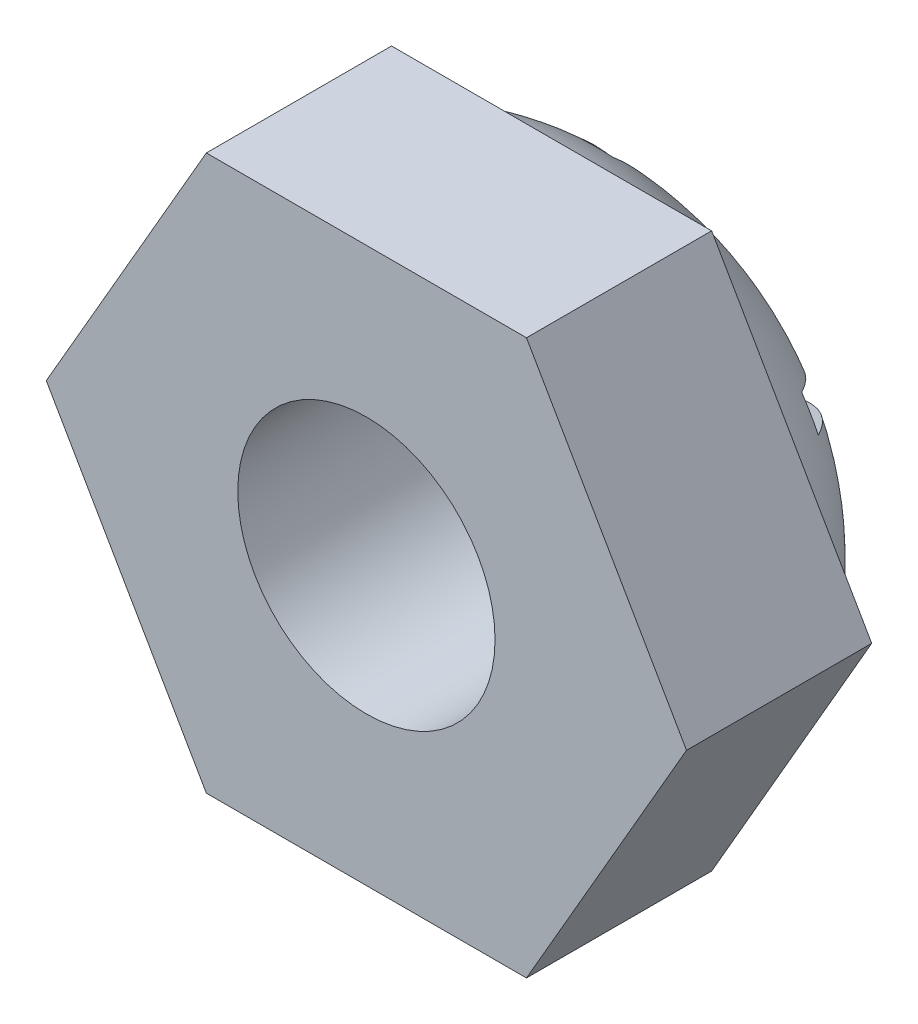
ISO-10303-21;
HEADER;
FILE_DESCRIPTION(('STEP AP214'),'2;1');
FILE_NAME('part.step','',(''),(''),'','','');
FILE_SCHEMA(('AUTOMOTIVE_DESIGN { 1 0 10303 214 1 1 1 1 }'));
ENDSEC;
DATA;
#1=APPLICATION_CONTEXT('core data for automotive mechanical design processes');
#2=APPLICATION_PROTOCOL_DEFINITION('international standard','automotive_design',2000,#1);
#3=PRODUCT_CONTEXT('',#1,'mechanical');
#4=PRODUCT('Part','Part','',(#3));
#5=PRODUCT_RELATED_PRODUCT_CATEGORY('part','',(#4));
#6=PRODUCT_DEFINITION_FORMATION('','',#4);
#7=PRODUCT_DEFINITION_CONTEXT('part definition',#1,'design');
#8=PRODUCT_DEFINITION('design','',#6,#7);
#9=PRODUCT_DEFINITION_SHAPE('','',#8);
#10=(LENGTH_UNIT() NAMED_UNIT(*) SI_UNIT(.MILLI.,.METRE.));
#11=(NAMED_UNIT(*) PLANE_ANGLE_UNIT() SI_UNIT($,.RADIAN.));
#12=(NAMED_UNIT(*) SI_UNIT($,.STERADIAN.) SOLID_ANGLE_UNIT());
#13=UNCERTAINTY_MEASURE_WITH_UNIT(LENGTH_MEASURE(1.E-05),#10,'distance_accuracy_value','');
#14=(GEOMETRIC_REPRESENTATION_CONTEXT(3) GLOBAL_UNCERTAINTY_ASSIGNED_CONTEXT((#13)) GLOBAL_UNIT_ASSIGNED_CONTEXT((#10,
#11,#12)) REPRESENTATION_CONTEXT('',''));
#15=CARTESIAN_POINT('',(0.,0.,0.));
#16=DIRECTION('',(0.,0.,1.));
#17=DIRECTION('',(1.,0.,0.));
#18=AXIS2_PLACEMENT_3D('',#15,#16,#17);
#19=CARTESIAN_POINT('',(0.,0.,-1.778));
#20=CARTESIAN_POINT('',(-2.39450497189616,0.,-1.51016537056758));
#21=CARTESIAN_POINT('',(-3.175,0.,0.));
#22=B_SPLINE_CURVE_WITH_KNOTS('',2,(#19,#20,#21),.UNSPECIFIED.,.F.,.F.,(3,3),(0.,1.),.UNSPECIFIED.);
#23=CARTESIAN_POINT('',(0.,0.,-1.778));
#24=DIRECTION('',(0.,0.,-1.));
#25=AXIS1_PLACEMENT('',#23,#24);
#26=SURFACE_OF_REVOLUTION('',#22,#25);
#27=CARTESIAN_POINT('',(0.,0.,0.));
#28=DIRECTION('',(0.,0.,-1.));
#29=DIRECTION('',(-1.,0.,0.));
#30=AXIS2_PLACEMENT_3D('',#27,#28,#29);
#31=CIRCLE('',#30,3.175);
#32=CARTESIAN_POINT('',(-2.74963065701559,1.5875,0.));
#33=VERTEX_POINT('',#32);
#34=CARTESIAN_POINT('',(0.,3.175,0.));
#35=VERTEX_POINT('',#34);
#36=EDGE_CURVE('E280',#33,#35,#31,.T.);
#37=ORIENTED_EDGE('',*,*,#36,.T.);
#38=CARTESIAN_POINT('',(2.74963065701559,1.5875,0.));
#39=VERTEX_POINT('',#38);
#40=EDGE_CURVE('E286',#35,#39,#31,.T.);
#41=ORIENTED_EDGE('',*,*,#40,.T.);
#42=CARTESIAN_POINT('',(2.74963065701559,-1.5875,0.));
#43=VERTEX_POINT('',#42);
#44=EDGE_CURVE('E358',#39,#43,#31,.T.);
#45=ORIENTED_EDGE('',*,*,#44,.T.);
#46=CARTESIAN_POINT('',(0.,-3.175,0.));
#47=VERTEX_POINT('',#46);
#48=EDGE_CURVE('E360',#43,#47,#31,.T.);
#49=ORIENTED_EDGE('',*,*,#48,.T.);
#50=CARTESIAN_POINT('',(-2.74963065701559,-1.5875,0.));
#51=VERTEX_POINT('',#50);
#52=EDGE_CURVE('E362',#47,#51,#31,.T.);
#53=ORIENTED_EDGE('',*,*,#52,.T.);
#54=EDGE_CURVE('E287',#51,#33,#31,.T.);
#55=ORIENTED_EDGE('',*,*,#54,.T.);
#56=EDGE_LOOP('',(#37,#41,#45,#49,#53,#55));
#57=FACE_BOUND('',#56,.T.);
#58=CARTESIAN_POINT('',(0.,0.,-1.44033778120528));
#59=DIRECTION('',(0.,0.,-1.));
#60=DIRECTION('',(-1.,0.,0.));
#61=AXIS2_PLACEMENT_3D('',#58,#59,#60);
#62=CIRCLE('',#61,1.47319999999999);
#63=CARTESIAN_POINT('',(1.36036698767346,0.565437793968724,-1.44033778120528));
#64=VERTEX_POINT('',#63);
#65=CARTESIAN_POINT('',(1.36036698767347,-0.565437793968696,-1.44033778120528));
#66=VERTEX_POINT('',#65);
#67=EDGE_CURVE('E232',#64,#66,#62,.T.);
#68=ORIENTED_EDGE('',*,*,#67,.F.);
#69=CARTESIAN_POINT('',(1.36036698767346,0.565437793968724,-1.44033778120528));
#70=CARTESIAN_POINT('',(1.41685944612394,0.598053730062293,-1.41558420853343));
#71=CARTESIAN_POINT('',(1.47283880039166,0.630373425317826,-1.38929873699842));
#72=CARTESIAN_POINT('',(1.58360054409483,0.694321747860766,-1.33341082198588));
#73=CARTESIAN_POINT('',(1.63838178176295,0.725949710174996,-1.30380534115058));
#74=CARTESIAN_POINT('',(1.79868874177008,0.818502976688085,-1.21076167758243));
#75=CARTESIAN_POINT('',(1.90210408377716,0.878209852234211,-1.1422719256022));
#76=CARTESIAN_POINT('',(2.05176431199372,0.964616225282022,-1.02797469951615));
#77=CARTESIAN_POINT('',(2.10113957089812,0.993123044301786,-0.98755068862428));
#78=CARTESIAN_POINT('',(2.19737540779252,1.04868483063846,-0.902876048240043));
#79=CARTESIAN_POINT('',(2.24423620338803,1.07573992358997,-0.85862575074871));
#80=CARTESIAN_POINT('',(2.33581554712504,1.12861328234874,-0.765566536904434));
#81=CARTESIAN_POINT('',(2.38048613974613,1.15440386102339,-0.716694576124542));
#82=CARTESIAN_POINT('',(2.46652015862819,1.20407562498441,-0.61515174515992));
#83=CARTESIAN_POINT('',(2.50788136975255,1.22795553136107,-0.562478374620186));
#84=CARTESIAN_POINT('',(2.54739714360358,1.2507699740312,-0.508));
#85=B_SPLINE_CURVE_WITH_KNOTS('',3,(#69,#70,#71,#72,#73,#74,#75,#76,#77,#78,#79,#80,#81,#82,#83,
#84),.UNSPECIFIED.,.F.,.F.,(4,2,2,2,2,2,2,4),(0.,0.209262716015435,0.41871846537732,
0.83054690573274,1.04008552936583,1.24960598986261,1.46257504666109,1.67568548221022),.UNSPECIFIED.);
#86=CARTESIAN_POINT('',(2.54739714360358,1.2507699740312,-0.508000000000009));
#87=VERTEX_POINT('',#86);
#88=EDGE_CURVE('E227',#64,#87,#85,.T.);
#89=ORIENTED_EDGE('',*,*,#88,.T.);
#90=CARTESIAN_POINT('',(0.,0.,-0.508000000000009));
#91=DIRECTION('',(0.,0.,-1.));
#92=DIRECTION('',(-0.50000000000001,0.866025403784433,0.));
#93=AXIS2_PLACEMENT_3D('',#90,#91,#92);
#94=CIRCLE('',#93,2.83789670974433);
#95=CARTESIAN_POINT('',(2.35689714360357,1.58072565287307,-0.508000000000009));
#96=VERTEX_POINT('',#95);
#97=EDGE_CURVE('E215',#96,#87,#94,.T.);
#98=ORIENTED_EDGE('',*,*,#97,.F.);
#99=CARTESIAN_POINT('',(2.35689714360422,1.58072565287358,-0.507999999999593));
#100=CARTESIAN_POINT('',(2.33104276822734,1.56579862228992,-0.543627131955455));
#101=CARTESIAN_POINT('',(2.30440795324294,1.55042100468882,-0.578487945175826));
#102=CARTESIAN_POINT('',(2.24966392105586,1.51881452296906,-0.646619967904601));
#103=CARTESIAN_POINT('',(2.22155494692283,1.50258579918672,-0.67989143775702));
#104=CARTESIAN_POINT('',(2.13580457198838,1.45307779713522,-0.77649736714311));
#105=CARTESIAN_POINT('',(2.0761331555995,1.41862648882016,-0.837455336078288));
#106=CARTESIAN_POINT('',(1.95186520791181,1.34688035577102,-0.953036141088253));
#107=CARTESIAN_POINT('',(1.8872441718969,1.3095713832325,-1.00762356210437));
#108=CARTESIAN_POINT('',(1.75412141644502,1.2327129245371,-1.11024041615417));
#109=CARTESIAN_POINT('',(1.68561557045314,1.19316105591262,-1.15826268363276));
#110=CARTESIAN_POINT('',(1.54392635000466,1.11135674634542,-1.24902549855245));
#111=CARTESIAN_POINT('',(1.47067066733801,1.06906255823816,-1.29161426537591));
#112=CARTESIAN_POINT('',(1.32185578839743,0.983144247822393,-1.37052160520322));
#113=CARTESIAN_POINT('',(1.2463020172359,0.93952325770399,-1.40685377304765));
#114=CARTESIAN_POINT('',(1.16986698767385,0.895393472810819,-1.4403377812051));
#115=B_SPLINE_CURVE_WITH_KNOTS('',3,(#99,#100,#101,#102,#103,#104,#105,#106,#107,#108,#109,#110,
#111,#112,#113,#114),.UNSPECIFIED.,.F.,.F.,(4,2,2,2,2,2,2,4),(0.,0.139414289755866,
0.278805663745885,0.554340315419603,0.831340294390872,1.10864023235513,1.39249860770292,
1.67573218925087),.UNSPECIFIED.);
#116=CARTESIAN_POINT('',(1.16986698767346,0.895393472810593,-1.44033778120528));
#117=VERTEX_POINT('',#116);
#118=EDGE_CURVE('E237',#96,#117,#115,.T.);
#119=ORIENTED_EDGE('',*,*,#118,.T.);
#120=CARTESIAN_POINT('',(0.1905,1.46083126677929,-1.44033778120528));
#121=VERTEX_POINT('',#120);
#122=EDGE_CURVE('E277',#121,#117,#62,.T.);
#123=ORIENTED_EDGE('',*,*,#122,.F.);
#124=CARTESIAN_POINT('',(0.1905,1.46083126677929,-1.44033778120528));
#125=CARTESIAN_POINT('',(0.1905,1.52606313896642,-1.41558420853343));
#126=CARTESIAN_POINT('',(0.1905,1.59070252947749,-1.38929873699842));
#127=CARTESIAN_POINT('',(0.1905,1.71859917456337,-1.33341082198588));
#128=CARTESIAN_POINT('',(0.1905,1.78185509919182,-1.30380534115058));
#129=CARTESIAN_POINT('',(0.1905,1.966961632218,-1.21076167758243));
#130=CARTESIAN_POINT('',(0.1905,2.08637538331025,-1.1422719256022));
#131=CARTESIAN_POINT('',(0.1905,2.25918812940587,-1.02797469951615));
#132=CARTESIAN_POINT('',(0.1905,2.31620176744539,-0.987550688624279));
#133=CARTESIAN_POINT('',(0.1905,2.42732534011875,-0.902876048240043));
#134=CARTESIAN_POINT('',(0.1905,2.48143552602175,-0.85862575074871));
#135=CARTESIAN_POINT('',(0.1905,2.5871822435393,-0.765566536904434));
#136=CARTESIAN_POINT('',(0.1905,2.6387634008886,-0.716694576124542));
#137=CARTESIAN_POINT('',(0.1905,2.73810692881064,-0.61515174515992));
#138=CARTESIAN_POINT('',(0.1905,2.78586674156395,-0.562478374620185));
#139=CARTESIAN_POINT('',(0.1905,2.83149562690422,-0.508));
#140=B_SPLINE_CURVE_WITH_KNOTS('',3,(#124,#125,#126,#127,#128,#129,#130,#131,#132,#133,#134,
#135,#136,#137,#138,#139),.UNSPECIFIED.,.F.,.F.,(4,2,2,2,2,2,2,4),(0.,0.209262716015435,
0.41871846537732,0.83054690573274,1.04008552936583,1.24960598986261,1.46257504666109,
1.67568548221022),.UNSPECIFIED.);
#141=CARTESIAN_POINT('',(0.1905,2.83149562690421,-0.508000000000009));
#142=VERTEX_POINT('',#141);
#143=EDGE_CURVE('E299',#121,#142,#140,.T.);
#144=ORIENTED_EDGE('',*,*,#143,.T.);
#145=CARTESIAN_POINT('',(0.,0.,-0.508000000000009));
#146=DIRECTION('',(0.,0.,-1.));
#147=DIRECTION('',(-1.,0.,0.));
#148=AXIS2_PLACEMENT_3D('',#145,#146,#147);
#149=CIRCLE('',#148,2.83789670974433);
#150=CARTESIAN_POINT('',(-0.1905,2.83149562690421,-0.508000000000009));
#151=VERTEX_POINT('',#150);
#152=EDGE_CURVE('E333',#151,#142,#149,.T.);
#153=ORIENTED_EDGE('',*,*,#152,.F.);
#154=CARTESIAN_POINT('',(-0.190500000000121,2.83149562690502,-0.507999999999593));
#155=CARTESIAN_POINT('',(-0.190500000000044,2.80164156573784,-0.543627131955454));
#156=CARTESIAN_POINT('',(-0.190500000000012,2.7708863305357,-0.578487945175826));
#157=CARTESIAN_POINT('',(-0.190499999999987,2.70767336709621,-0.646619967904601));
#158=CARTESIAN_POINT('',(-0.190499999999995,2.67521591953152,-0.67989143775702));
#159=CARTESIAN_POINT('',(-0.190500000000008,2.5761999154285,-0.77649736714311));
#160=CARTESIAN_POINT('',(-0.190500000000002,2.5072972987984,-0.837455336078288));
#161=CARTESIAN_POINT('',(-0.190499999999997,2.36380503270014,-0.953036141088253));
#162=CARTESIAN_POINT('',(-0.190499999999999,2.2891870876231,-1.00762356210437));
#163=CARTESIAN_POINT('',(-0.1905,2.13547017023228,-1.11024041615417));
#164=CARTESIAN_POINT('',(-0.1905,2.05636643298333,-1.15826268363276));
#165=CARTESIAN_POINT('',(-0.1905,1.89275781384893,-1.24902549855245));
#166=CARTESIAN_POINT('',(-0.1905,1.80816943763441,-1.29161426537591));
#167=CARTESIAN_POINT('',(-0.1905,1.63633281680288,-1.37052160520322));
#168=CARTESIAN_POINT('',(-0.190499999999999,1.54909083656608,-1.40685377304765));
#169=CARTESIAN_POINT('',(-0.190499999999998,1.46083126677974,-1.4403377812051));
#170=B_SPLINE_CURVE_WITH_KNOTS('',3,(#154,#155,#156,#157,#158,#159,#160,#161,#162,#163,#164,
#165,#166,#167,#168,#169),.UNSPECIFIED.,.F.,.F.,(4,2,2,2,2,2,2,4),(0.,0.139414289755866,
0.278805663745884,0.554340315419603,0.831340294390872,1.10864023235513,1.39249860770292,
1.67573218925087),.UNSPECIFIED.);
#171=CARTESIAN_POINT('',(-0.1905,1.46083126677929,-1.44033778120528));
#172=VERTEX_POINT('',#171);
#173=EDGE_CURVE('E303',#151,#172,#170,.T.);
#174=ORIENTED_EDGE('',*,*,#173,.T.);
#175=CARTESIAN_POINT('',(-1.16986698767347,0.895393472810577,-1.44033778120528));
#176=VERTEX_POINT('',#175);
#177=EDGE_CURVE('E282',#176,#172,#62,.T.);
#178=ORIENTED_EDGE('',*,*,#177,.F.);
#179=CARTESIAN_POINT('',(-1.16986698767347,0.895393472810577,-1.44033778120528));
#180=CARTESIAN_POINT('',(-1.22635944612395,0.928009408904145,-1.41558420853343));
#181=CARTESIAN_POINT('',(-1.28233880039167,0.960329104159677,-1.38929873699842));
#182=CARTESIAN_POINT('',(-1.39310054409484,1.02427742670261,-1.33341082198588));
#183=CARTESIAN_POINT('',(-1.44788178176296,1.05590538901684,-1.30380534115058));
#184=CARTESIAN_POINT('',(-1.60818874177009,1.14845865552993,-1.21076167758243));
#185=CARTESIAN_POINT('',(-1.71160408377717,1.20816553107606,-1.1422719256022));
#186=CARTESIAN_POINT('',(-1.86126431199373,1.29457190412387,-1.02797469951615));
#187=CARTESIAN_POINT('',(-1.91063957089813,1.32307872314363,-0.98755068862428));
#188=CARTESIAN_POINT('',(-2.00687540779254,1.3786405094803,-0.902876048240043));
#189=CARTESIAN_POINT('',(-2.05373620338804,1.40569560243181,-0.85862575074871));
#190=CARTESIAN_POINT('',(-2.14531554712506,1.45856896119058,-0.765566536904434));
#191=CARTESIAN_POINT('',(-2.18998613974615,1.48435953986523,-0.716694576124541));
#192=CARTESIAN_POINT('',(-2.2760201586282,1.53403130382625,-0.61515174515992));
#193=CARTESIAN_POINT('',(-2.31738136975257,1.55791121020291,-0.562478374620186));
#194=CARTESIAN_POINT('',(-2.3568971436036,1.58072565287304,-0.508));
#195=B_SPLINE_CURVE_WITH_KNOTS('',3,(#179,#180,#181,#182,#183,#184,#185,#186,#187,#188,#189,
#190,#191,#192,#193,#194),.UNSPECIFIED.,.F.,.F.,(4,2,2,2,2,2,2,4),(0.,0.209262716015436,
0.41871846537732,0.83054690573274,1.04008552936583,1.24960598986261,1.46257504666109,
1.67568548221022),.UNSPECIFIED.);
#196=CARTESIAN_POINT('',(-2.3568971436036,1.58072565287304,-0.508000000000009));
#197=VERTEX_POINT('',#196);
#198=EDGE_CURVE('E844',#176,#197,#195,.T.);
#199=ORIENTED_EDGE('',*,*,#198,.T.);
#200=CARTESIAN_POINT('',(0.,0.,-0.508000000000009));
#201=DIRECTION('',(0.,0.,-1.));
#202=DIRECTION('',(-0.499999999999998,-0.86602540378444,0.));
#203=AXIS2_PLACEMENT_3D('',#200,#201,#202);
#204=CIRCLE('',#203,2.83789670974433);
#205=CARTESIAN_POINT('',(-2.54739714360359,1.25076997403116,-0.508000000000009));
#206=VERTEX_POINT('',#205);
#207=EDGE_CURVE('E816',#206,#197,#204,.T.);
#208=ORIENTED_EDGE('',*,*,#207,.F.);
#209=CARTESIAN_POINT('',(-2.54739714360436,1.25076997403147,-0.507999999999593));
#210=CARTESIAN_POINT('',(-2.5215427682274,1.23584294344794,-0.543627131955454));
#211=CARTESIAN_POINT('',(-2.49490795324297,1.2204653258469,-0.578487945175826));
#212=CARTESIAN_POINT('',(-2.44016392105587,1.18885884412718,-0.646619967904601));
#213=CARTESIAN_POINT('',(-2.41205494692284,1.17263012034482,-0.67989143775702));
#214=CARTESIAN_POINT('',(-2.32630457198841,1.1231221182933,-0.77649736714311));
#215=CARTESIAN_POINT('',(-2.26663315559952,1.08867080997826,-0.837455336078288));
#216=CARTESIAN_POINT('',(-2.14236520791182,1.01692467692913,-0.953036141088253));
#217=CARTESIAN_POINT('',(-2.07774417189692,0.979615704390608,-1.00762356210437));
#218=CARTESIAN_POINT('',(-1.94462141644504,0.902757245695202,-1.11024041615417));
#219=CARTESIAN_POINT('',(-1.87611557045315,0.863205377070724,-1.15826268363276));
#220=CARTESIAN_POINT('',(-1.73442635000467,0.781401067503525,-1.24902549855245));
#221=CARTESIAN_POINT('',(-1.66117066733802,0.739106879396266,-1.29161426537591));
#222=CARTESIAN_POINT('',(-1.51235578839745,0.653188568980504,-1.37052160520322));
#223=CARTESIAN_POINT('',(-1.43680201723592,0.609567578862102,-1.40685377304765));
#224=CARTESIAN_POINT('',(-1.36036698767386,0.565437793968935,-1.4403377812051));
#225=B_SPLINE_CURVE_WITH_KNOTS('',3,(#209,#210,#211,#212,#213,#214,#215,#216,#217,#218,#219,
#220,#221,#222,#223,#224),.UNSPECIFIED.,.F.,.F.,(4,2,2,2,2,2,2,4),(0.,0.139414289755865,
0.278805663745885,0.554340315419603,0.831340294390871,1.10864023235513,1.39249860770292,
1.67573218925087),.UNSPECIFIED.);
#226=CARTESIAN_POINT('',(-1.36036698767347,0.565437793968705,-1.44033778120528));
#227=VERTEX_POINT('',#226);
#228=EDGE_CURVE('E829',#206,#227,#225,.T.);
#229=ORIENTED_EDGE('',*,*,#228,.T.);
#230=CARTESIAN_POINT('',(-1.36036698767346,-0.565437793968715,-1.44033778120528));
#231=VERTEX_POINT('',#230);
#232=EDGE_CURVE('E291',#231,#227,#62,.T.);
#233=ORIENTED_EDGE('',*,*,#232,.F.);
#234=CARTESIAN_POINT('',(-1.36036698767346,-0.565437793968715,-1.44033778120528));
#235=CARTESIAN_POINT('',(-1.41685944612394,-0.598053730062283,-1.41558420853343));
#236=CARTESIAN_POINT('',(-1.47283880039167,-0.630373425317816,-1.38929873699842));
#237=CARTESIAN_POINT('',(-1.58360054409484,-0.694321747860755,-1.33341082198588));
#238=CARTESIAN_POINT('',(-1.63838178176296,-0.725949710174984,-1.30380534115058));
#239=CARTESIAN_POINT('',(-1.79868874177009,-0.818502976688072,-1.21076167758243));
#240=CARTESIAN_POINT('',(-1.90210408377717,-0.878209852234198,-1.1422719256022));
#241=CARTESIAN_POINT('',(-2.05176431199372,-0.964616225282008,-1.02797469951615));
#242=CARTESIAN_POINT('',(-2.10113957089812,-0.993123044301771,-0.987550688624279));
#243=CARTESIAN_POINT('',(-2.19737540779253,-1.04868483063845,-0.902876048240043));
#244=CARTESIAN_POINT('',(-2.24423620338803,-1.07573992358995,-0.85862575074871));
#245=CARTESIAN_POINT('',(-2.33581554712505,-1.12861328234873,-0.765566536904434));
#246=CARTESIAN_POINT('',(-2.38048613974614,-1.15440386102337,-0.716694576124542));
#247=CARTESIAN_POINT('',(-2.46652015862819,-1.20407562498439,-0.61515174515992));
#248=CARTESIAN_POINT('',(-2.50788136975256,-1.22795553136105,-0.562478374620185));
#249=CARTESIAN_POINT('',(-2.54739714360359,-1.25076997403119,-0.508));
#250=B_SPLINE_CURVE_WITH_KNOTS('',3,(#234,#235,#236,#237,#238,#239,#240,#241,#242,#243,#244,
#245,#246,#247,#248,#249),.UNSPECIFIED.,.F.,.F.,(4,2,2,2,2,2,2,4),(0.,0.209262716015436,
0.418718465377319,0.83054690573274,1.04008552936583,1.24960598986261,1.46257504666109,
1.67568548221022),.UNSPECIFIED.);
#251=CARTESIAN_POINT('',(-2.54739714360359,-1.25076997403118,-0.508000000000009));
#252=VERTEX_POINT('',#251);
#253=EDGE_CURVE('E810',#231,#252,#250,.T.);
#254=ORIENTED_EDGE('',*,*,#253,.T.);
#255=CARTESIAN_POINT('',(0.,0.,-0.508000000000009));
#256=DIRECTION('',(0.,0.,-1.));
#257=DIRECTION('',(0.500000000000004,-0.866025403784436,0.));
#258=AXIS2_PLACEMENT_3D('',#255,#256,#257);
#259=CIRCLE('',#258,2.83789670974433);
#260=CARTESIAN_POINT('',(-2.35689714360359,-1.58072565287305,-0.508000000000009));
#261=VERTEX_POINT('',#260);
#262=EDGE_CURVE('E781',#261,#252,#259,.T.);
#263=ORIENTED_EDGE('',*,*,#262,.F.);
#264=CARTESIAN_POINT('',(-2.35689714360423,-1.58072565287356,-0.507999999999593));
#265=CARTESIAN_POINT('',(-2.33104276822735,-1.5657986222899,-0.543627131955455));
#266=CARTESIAN_POINT('',(-2.30440795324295,-1.55042100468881,-0.578487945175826));
#267=CARTESIAN_POINT('',(-2.24966392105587,-1.51881452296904,-0.646619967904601));
#268=CARTESIAN_POINT('',(-2.22155494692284,-1.5025857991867,-0.679891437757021));
#269=CARTESIAN_POINT('',(-2.13580457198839,-1.4530777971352,-0.77649736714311));
#270=CARTESIAN_POINT('',(-2.07613315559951,-1.41862648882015,-0.837455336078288));
#271=CARTESIAN_POINT('',(-1.95186520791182,-1.34688035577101,-0.953036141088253));
#272=CARTESIAN_POINT('',(-1.88724417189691,-1.30957138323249,-1.00762356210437));
#273=CARTESIAN_POINT('',(-1.75412141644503,-1.23271292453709,-1.11024041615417));
#274=CARTESIAN_POINT('',(-1.68561557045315,-1.19316105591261,-1.15826268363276));
#275=CARTESIAN_POINT('',(-1.54392635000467,-1.11135674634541,-1.24902549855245));
#276=CARTESIAN_POINT('',(-1.47067066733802,-1.06906255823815,-1.29161426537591));
#277=CARTESIAN_POINT('',(-1.32185578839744,-0.983144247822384,-1.37052160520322));
#278=CARTESIAN_POINT('',(-1.24630201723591,-0.939523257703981,-1.40685377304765));
#279=CARTESIAN_POINT('',(-1.16986698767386,-0.895393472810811,-1.4403377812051));
#280=B_SPLINE_CURVE_WITH_KNOTS('',3,(#264,#265,#266,#267,#268,#269,#270,#271,#272,#273,#274,
#275,#276,#277,#278,#279),.UNSPECIFIED.,.F.,.F.,(4,2,2,2,2,2,2,4),(0.,0.139414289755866,
0.278805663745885,0.554340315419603,0.831340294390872,1.10864023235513,1.39249860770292,
1.67573218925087),.UNSPECIFIED.);
#281=CARTESIAN_POINT('',(-1.16986698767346,-0.895393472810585,-1.44033778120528));
#282=VERTEX_POINT('',#281);
#283=EDGE_CURVE('E794',#261,#282,#280,.T.);
#284=ORIENTED_EDGE('',*,*,#283,.T.);
#285=CARTESIAN_POINT('',(-0.1905,-1.46083126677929,-1.44033778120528));
#286=VERTEX_POINT('',#285);
#287=EDGE_CURVE('E297',#286,#282,#62,.T.);
#288=ORIENTED_EDGE('',*,*,#287,.F.);
#289=CARTESIAN_POINT('',(-0.1905,-1.46083126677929,-1.44033778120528));
#290=CARTESIAN_POINT('',(-0.1905,-1.52606313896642,-1.41558420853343));
#291=CARTESIAN_POINT('',(-0.1905,-1.59070252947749,-1.38929873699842));
#292=CARTESIAN_POINT('',(-0.1905,-1.71859917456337,-1.33341082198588));
#293=CARTESIAN_POINT('',(-0.1905,-1.78185509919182,-1.30380534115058));
#294=CARTESIAN_POINT('',(-0.1905,-1.966961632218,-1.21076167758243));
#295=CARTESIAN_POINT('',(-0.1905,-2.08637538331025,-1.1422719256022));
#296=CARTESIAN_POINT('',(-0.1905,-2.25918812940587,-1.02797469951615));
#297=CARTESIAN_POINT('',(-0.1905,-2.31620176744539,-0.987550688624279));
#298=CARTESIAN_POINT('',(-0.1905,-2.42732534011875,-0.902876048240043));
#299=CARTESIAN_POINT('',(-0.1905,-2.48143552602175,-0.85862575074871));
#300=CARTESIAN_POINT('',(-0.1905,-2.5871822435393,-0.765566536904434));
#301=CARTESIAN_POINT('',(-0.1905,-2.6387634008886,-0.716694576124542));
#302=CARTESIAN_POINT('',(-0.1905,-2.73810692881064,-0.61515174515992));
#303=CARTESIAN_POINT('',(-0.1905,-2.78586674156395,-0.562478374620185));
#304=CARTESIAN_POINT('',(-0.1905,-2.83149562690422,-0.508));
#305=B_SPLINE_CURVE_WITH_KNOTS('',3,(#289,#290,#291,#292,#293,#294,#295,#296,#297,#298,#299,
#300,#301,#302,#303,#304),.UNSPECIFIED.,.F.,.F.,(4,2,2,2,2,2,2,4),(0.,0.209262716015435,
0.41871846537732,0.83054690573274,1.04008552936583,1.24960598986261,1.46257504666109,
1.67568548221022),.UNSPECIFIED.);
#306=CARTESIAN_POINT('',(-0.1905,-2.83149562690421,-0.508000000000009));
#307=VERTEX_POINT('',#306);
#308=EDGE_CURVE('E775',#286,#307,#305,.T.);
#309=ORIENTED_EDGE('',*,*,#308,.T.);
#310=CARTESIAN_POINT('',(0.,0.,-0.508000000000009));
#311=DIRECTION('',(0.,0.,-1.));
#312=DIRECTION('',(1.,0.,0.));
#313=AXIS2_PLACEMENT_3D('',#310,#311,#312);
#314=CIRCLE('',#313,2.83789670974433);
#315=CARTESIAN_POINT('',(0.1905,-2.83149562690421,-0.508000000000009));
#316=VERTEX_POINT('',#315);
#317=EDGE_CURVE('E746',#316,#307,#314,.T.);
#318=ORIENTED_EDGE('',*,*,#317,.F.);
#319=CARTESIAN_POINT('',(0.190500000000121,-2.83149562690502,-0.507999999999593));
#320=CARTESIAN_POINT('',(0.190500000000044,-2.80164156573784,-0.543627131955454));
#321=CARTESIAN_POINT('',(0.190500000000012,-2.7708863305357,-0.578487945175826));
#322=CARTESIAN_POINT('',(0.190499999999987,-2.70767336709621,-0.646619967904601));
#323=CARTESIAN_POINT('',(0.190499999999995,-2.67521591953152,-0.67989143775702));
#324=CARTESIAN_POINT('',(0.190500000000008,-2.5761999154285,-0.77649736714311));
#325=CARTESIAN_POINT('',(0.190500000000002,-2.5072972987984,-0.837455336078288));
#326=CARTESIAN_POINT('',(0.190499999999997,-2.36380503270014,-0.953036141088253));
#327=CARTESIAN_POINT('',(0.190499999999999,-2.2891870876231,-1.00762356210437));
#328=CARTESIAN_POINT('',(0.1905,-2.13547017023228,-1.11024041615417));
#329=CARTESIAN_POINT('',(0.1905,-2.05636643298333,-1.15826268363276));
#330=CARTESIAN_POINT('',(0.1905,-1.89275781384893,-1.24902549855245));
#331=CARTESIAN_POINT('',(0.1905,-1.80816943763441,-1.29161426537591));
#332=CARTESIAN_POINT('',(0.1905,-1.63633281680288,-1.37052160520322));
#333=CARTESIAN_POINT('',(0.190499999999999,-1.54909083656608,-1.40685377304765));
#334=CARTESIAN_POINT('',(0.190499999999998,-1.46083126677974,-1.4403377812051));
#335=B_SPLINE_CURVE_WITH_KNOTS('',3,(#319,#320,#321,#322,#323,#324,#325,#326,#327,#328,#329,
#330,#331,#332,#333,#334),.UNSPECIFIED.,.F.,.F.,(4,2,2,2,2,2,2,4),(0.,0.139414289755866,
0.278805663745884,0.554340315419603,0.831340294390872,1.10864023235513,1.39249860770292,
1.67573218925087),.UNSPECIFIED.);
#336=CARTESIAN_POINT('',(0.1905,-1.46083126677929,-1.44033778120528));
#337=VERTEX_POINT('',#336);
#338=EDGE_CURVE('E759',#316,#337,#335,.T.);
#339=ORIENTED_EDGE('',*,*,#338,.T.);
#340=CARTESIAN_POINT('',(1.16986698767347,-0.895393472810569,-1.44033778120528));
#341=VERTEX_POINT('',#340);
#342=EDGE_CURVE('E288',#341,#337,#62,.T.);
#343=ORIENTED_EDGE('',*,*,#342,.F.);
#344=CARTESIAN_POINT('',(1.16986698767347,-0.895393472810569,-1.44033778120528));
#345=CARTESIAN_POINT('',(1.22635944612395,-0.928009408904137,-1.41558420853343));
#346=CARTESIAN_POINT('',(1.28233880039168,-0.960329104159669,-1.38929873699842));
#347=CARTESIAN_POINT('',(1.39310054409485,-1.02427742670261,-1.33341082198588));
#348=CARTESIAN_POINT('',(1.44788178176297,-1.05590538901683,-1.30380534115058));
#349=CARTESIAN_POINT('',(1.6081887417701,-1.14845865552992,-1.21076167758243));
#350=CARTESIAN_POINT('',(1.71160408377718,-1.20816553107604,-1.1422719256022));
#351=CARTESIAN_POINT('',(1.86126431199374,-1.29457190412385,-1.02797469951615));
#352=CARTESIAN_POINT('',(1.91063957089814,-1.32307872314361,-0.987550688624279));
#353=CARTESIAN_POINT('',(2.00687540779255,-1.37864050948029,-0.902876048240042));
#354=CARTESIAN_POINT('',(2.05373620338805,-1.40569560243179,-0.85862575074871));
#355=CARTESIAN_POINT('',(2.14531554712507,-1.45856896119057,-0.765566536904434));
#356=CARTESIAN_POINT('',(2.18998613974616,-1.48435953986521,-0.716694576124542));
#357=CARTESIAN_POINT('',(2.27602015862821,-1.53403130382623,-0.61515174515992));
#358=CARTESIAN_POINT('',(2.31738136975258,-1.55791121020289,-0.562478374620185));
#359=CARTESIAN_POINT('',(2.35689714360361,-1.58072565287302,-0.508));
#360=B_SPLINE_CURVE_WITH_KNOTS('',3,(#344,#345,#346,#347,#348,#349,#350,#351,#352,#353,#354,
#355,#356,#357,#358,#359),.UNSPECIFIED.,.F.,.F.,(4,2,2,2,2,2,2,4),(0.,0.209262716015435,
0.41871846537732,0.83054690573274,1.04008552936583,1.24960598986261,1.46257504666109,
1.67568548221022),.UNSPECIFIED.);
#361=CARTESIAN_POINT('',(2.35689714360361,-1.58072565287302,-0.508000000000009));
#362=VERTEX_POINT('',#361);
#363=EDGE_CURVE('E740',#341,#362,#360,.T.);
#364=ORIENTED_EDGE('',*,*,#363,.T.);
#365=CARTESIAN_POINT('',(0.,0.,-0.508000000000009));
#366=DIRECTION('',(0.,0.,-1.));
#367=DIRECTION('',(0.499999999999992,0.866025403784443,0.));
#368=AXIS2_PLACEMENT_3D('',#365,#366,#367);
#369=CIRCLE('',#368,2.83789670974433);
#370=CARTESIAN_POINT('',(2.5473971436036,-1.25076997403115,-0.508000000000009));
#371=VERTEX_POINT('',#370);
#372=EDGE_CURVE('E233',#371,#362,#369,.T.);
#373=ORIENTED_EDGE('',*,*,#372,.F.);
#374=CARTESIAN_POINT('',(2.54739714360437,-1.25076997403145,-0.507999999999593));
#375=CARTESIAN_POINT('',(2.52154276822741,-1.23584294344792,-0.543627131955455));
#376=CARTESIAN_POINT('',(2.49490795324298,-1.22046532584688,-0.578487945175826));
#377=CARTESIAN_POINT('',(2.44016392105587,-1.18885884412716,-0.646619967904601));
#378=CARTESIAN_POINT('',(2.41205494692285,-1.17263012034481,-0.67989143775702));
#379=CARTESIAN_POINT('',(2.32630457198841,-1.12312211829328,-0.77649736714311));
#380=CARTESIAN_POINT('',(2.26663315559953,-1.08867080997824,-0.837455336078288));
#381=CARTESIAN_POINT('',(2.14236520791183,-1.01692467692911,-0.953036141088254));
#382=CARTESIAN_POINT('',(2.07774417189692,-0.979615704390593,-1.00762356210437));
#383=CARTESIAN_POINT('',(1.94462141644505,-0.902757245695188,-1.11024041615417));
#384=CARTESIAN_POINT('',(1.87611557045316,-0.863205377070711,-1.15826268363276));
#385=CARTESIAN_POINT('',(1.73442635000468,-0.781401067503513,-1.24902549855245));
#386=CARTESIAN_POINT('',(1.66117066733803,-0.739106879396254,-1.29161426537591));
#387=CARTESIAN_POINT('',(1.51235578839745,-0.653188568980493,-1.37052160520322));
#388=CARTESIAN_POINT('',(1.43680201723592,-0.609567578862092,-1.40685377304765));
#389=CARTESIAN_POINT('',(1.36036698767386,-0.565437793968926,-1.4403377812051));
#390=B_SPLINE_CURVE_WITH_KNOTS('',3,(#374,#375,#376,#377,#378,#379,#380,#381,#382,#383,#384,
#385,#386,#387,#388,#389),.UNSPECIFIED.,.F.,.F.,(4,2,2,2,2,2,2,4),(0.,0.139414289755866,
0.278805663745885,0.554340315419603,0.831340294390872,1.10864023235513,1.39249860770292,
1.67573218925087),.UNSPECIFIED.);
#391=EDGE_CURVE('E725',#371,#66,#390,.T.);
#392=ORIENTED_EDGE('',*,*,#391,.T.);
#393=EDGE_LOOP('',(#68,#89,#98,#119,#123,#144,#153,#174,#178,#199,#208,#229,#233,#254,#263,#284,
#288,#309,#318,#339,#343,#364,#373,#392));
#394=FACE_BOUND('',#393,.T.);
#395=ADVANCED_FACE('F35',(#57,#394),#26,.F.);
#396=CARTESIAN_POINT('',(0.,0.,2.1209));
#397=DIRECTION('',(0.,0.,1.));
#398=DIRECTION('',(1.,0.,0.));
#399=AXIS2_PLACEMENT_3D('',#396,#397,#398);
#400=CYLINDRICAL_SURFACE('',#399,1.47319999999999);
#401=CARTESIAN_POINT('',(0.,0.,2.1209));
#402=DIRECTION('',(0.,0.,1.));
#403=DIRECTION('',(1.,0.,0.));
#404=AXIS2_PLACEMENT_3D('',#401,#402,#403);
#405=CIRCLE('',#404,1.47319999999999);
#406=CARTESIAN_POINT('',(1.47319999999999,0.,2.1209));
#407=VERTEX_POINT('',#406);
#408=EDGE_CURVE('E292',#407,#407,#405,.T.);
#409=ORIENTED_EDGE('',*,*,#408,.T.);
#410=EDGE_LOOP('',(#409));
#411=FACE_BOUND('',#410,.T.);
#412=DIRECTION('',(0.,0.,1.));
#413=VECTOR('',#412,1.);
#414=CARTESIAN_POINT('',(1.36036698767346,0.565437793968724,2.1209));
#415=LINE('',#414,#413);
#416=CARTESIAN_POINT('',(1.36036698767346,0.565437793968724,-0.508));
#417=VERTEX_POINT('',#416);
#418=EDGE_CURVE('E50',#64,#417,#415,.T.);
#419=ORIENTED_EDGE('',*,*,#418,.F.);
#420=ORIENTED_EDGE('',*,*,#67,.T.);
#421=DIRECTION('',(0.,0.,1.));
#422=VECTOR('',#421,1.);
#423=CARTESIAN_POINT('',(1.36036698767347,-0.565437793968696,2.1209));
#424=LINE('',#423,#422);
#425=CARTESIAN_POINT('',(1.36036698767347,-0.565437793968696,-0.508));
#426=VERTEX_POINT('',#425);
#427=EDGE_CURVE('E731',#426,#66,#424,.F.);
#428=ORIENTED_EDGE('',*,*,#427,.F.);
#429=CARTESIAN_POINT('',(0.,0.,-0.508));
#430=DIRECTION('',(0.,0.,1.));
#431=DIRECTION('',(-0.499999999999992,-0.866025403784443,0.));
#432=AXIS2_PLACEMENT_3D('',#429,#430,#431);
#433=CIRCLE('',#432,1.47319999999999);
#434=CARTESIAN_POINT('',(1.16986698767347,-0.895393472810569,-0.508));
#435=VERTEX_POINT('',#434);
#436=EDGE_CURVE('E874',#426,#435,#433,.F.);
#437=ORIENTED_EDGE('',*,*,#436,.T.);
#438=DIRECTION('',(0.,0.,1.));
#439=VECTOR('',#438,1.);
#440=CARTESIAN_POINT('',(1.16986698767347,-0.895393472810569,2.1209));
#441=LINE('',#440,#439);
#442=EDGE_CURVE('E58',#341,#435,#441,.T.);
#443=ORIENTED_EDGE('',*,*,#442,.F.);
#444=ORIENTED_EDGE('',*,*,#342,.T.);
#445=DIRECTION('',(0.,0.,1.));
#446=VECTOR('',#445,1.);
#447=CARTESIAN_POINT('',(0.1905,-1.46083126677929,2.1209));
#448=LINE('',#447,#446);
#449=CARTESIAN_POINT('',(0.1905,-1.46083126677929,-0.508));
#450=VERTEX_POINT('',#449);
#451=EDGE_CURVE('E756',#450,#337,#448,.F.);
#452=ORIENTED_EDGE('',*,*,#451,.F.);
#453=CARTESIAN_POINT('',(0.,0.,-0.508));
#454=DIRECTION('',(0.,0.,1.));
#455=DIRECTION('',(-1.,0.,0.));
#456=AXIS2_PLACEMENT_3D('',#453,#454,#455);
#457=CIRCLE('',#456,1.47319999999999);
#458=CARTESIAN_POINT('',(-0.1905,-1.46083126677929,-0.508));
#459=VERTEX_POINT('',#458);
#460=EDGE_CURVE('E751',#450,#459,#457,.F.);
#461=ORIENTED_EDGE('',*,*,#460,.T.);
#462=DIRECTION('',(0.,0.,1.));
#463=VECTOR('',#462,1.);
#464=CARTESIAN_POINT('',(-0.1905,-1.46083126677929,2.1209));
#465=LINE('',#464,#463);
#466=EDGE_CURVE('E766',#286,#459,#465,.T.);
#467=ORIENTED_EDGE('',*,*,#466,.F.);
#468=ORIENTED_EDGE('',*,*,#287,.T.);
#469=DIRECTION('',(0.,0.,1.));
#470=VECTOR('',#469,1.);
#471=CARTESIAN_POINT('',(-1.16986698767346,-0.895393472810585,2.1209));
#472=LINE('',#471,#470);
#473=CARTESIAN_POINT('',(-1.16986698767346,-0.895393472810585,-0.508));
#474=VERTEX_POINT('',#473);
#475=EDGE_CURVE('E791',#474,#282,#472,.F.);
#476=ORIENTED_EDGE('',*,*,#475,.F.);
#477=CARTESIAN_POINT('',(0.,0.,-0.508));
#478=DIRECTION('',(0.,0.,1.));
#479=DIRECTION('',(-0.500000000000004,0.866025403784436,0.));
#480=AXIS2_PLACEMENT_3D('',#477,#478,#479);
#481=CIRCLE('',#480,1.47319999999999);
#482=CARTESIAN_POINT('',(-1.36036698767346,-0.565437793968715,-0.508));
#483=VERTEX_POINT('',#482);
#484=EDGE_CURVE('E786',#474,#483,#481,.F.);
#485=ORIENTED_EDGE('',*,*,#484,.T.);
#486=DIRECTION('',(0.,0.,1.));
#487=VECTOR('',#486,1.);
#488=CARTESIAN_POINT('',(-1.36036698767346,-0.565437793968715,2.1209));
#489=LINE('',#488,#487);
#490=EDGE_CURVE('E801',#231,#483,#489,.T.);
#491=ORIENTED_EDGE('',*,*,#490,.F.);
#492=ORIENTED_EDGE('',*,*,#232,.T.);
#493=DIRECTION('',(0.,0.,1.));
#494=VECTOR('',#493,1.);
#495=CARTESIAN_POINT('',(-1.36036698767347,0.565437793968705,2.1209));
#496=LINE('',#495,#494);
#497=CARTESIAN_POINT('',(-1.36036698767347,0.565437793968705,-0.508));
#498=VERTEX_POINT('',#497);
#499=EDGE_CURVE('E826',#498,#227,#496,.F.);
#500=ORIENTED_EDGE('',*,*,#499,.F.);
#501=CARTESIAN_POINT('',(0.,0.,-0.508));
#502=DIRECTION('',(0.,0.,1.));
#503=DIRECTION('',(0.499999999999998,0.86602540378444,0.));
#504=AXIS2_PLACEMENT_3D('',#501,#502,#503);
#505=CIRCLE('',#504,1.47319999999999);
#506=CARTESIAN_POINT('',(-1.16986698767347,0.895393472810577,-0.508));
#507=VERTEX_POINT('',#506);
#508=EDGE_CURVE('E821',#498,#507,#505,.F.);
#509=ORIENTED_EDGE('',*,*,#508,.T.);
#510=DIRECTION('',(0.,0.,1.));
#511=VECTOR('',#510,1.);
#512=CARTESIAN_POINT('',(-1.16986698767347,0.895393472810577,2.1209));
#513=LINE('',#512,#511);
#514=EDGE_CURVE('E835',#176,#507,#513,.T.);
#515=ORIENTED_EDGE('',*,*,#514,.F.);
#516=ORIENTED_EDGE('',*,*,#177,.T.);
#517=DIRECTION('',(0.,0.,1.));
#518=VECTOR('',#517,1.);
#519=CARTESIAN_POINT('',(-0.1905,1.46083126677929,2.1209));
#520=LINE('',#519,#518);
#521=CARTESIAN_POINT('',(-0.1905,1.46083126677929,-0.508));
#522=VERTEX_POINT('',#521);
#523=EDGE_CURVE('E43',#522,#172,#520,.F.);
#524=ORIENTED_EDGE('',*,*,#523,.F.);
#525=CARTESIAN_POINT('',(0.,0.,-0.508));
#526=DIRECTION('',(0.,0.,1.));
#527=DIRECTION('',(1.,0.,0.));
#528=AXIS2_PLACEMENT_3D('',#525,#526,#527);
#529=CIRCLE('',#528,1.47319999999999);
#530=CARTESIAN_POINT('',(0.1905,1.46083126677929,-0.508));
#531=VERTEX_POINT('',#530);
#532=EDGE_CURVE('E353',#522,#531,#529,.F.);
#533=ORIENTED_EDGE('',*,*,#532,.T.);
#534=DIRECTION('',(0.,0.,1.));
#535=VECTOR('',#534,1.);
#536=CARTESIAN_POINT('',(0.1905,1.46083126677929,2.1209));
#537=LINE('',#536,#535);
#538=EDGE_CURVE('E11',#121,#531,#537,.T.);
#539=ORIENTED_EDGE('',*,*,#538,.F.);
#540=ORIENTED_EDGE('',*,*,#122,.T.);
#541=DIRECTION('',(0.,0.,1.));
#542=VECTOR('',#541,1.);
#543=CARTESIAN_POINT('',(1.16986698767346,0.895393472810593,2.1209));
#544=LINE('',#543,#542);
#545=CARTESIAN_POINT('',(1.16986698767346,0.895393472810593,-0.508));
#546=VERTEX_POINT('',#545);
#547=EDGE_CURVE('E262',#546,#117,#544,.F.);
#548=ORIENTED_EDGE('',*,*,#547,.F.);
#549=CARTESIAN_POINT('',(0.,0.,-0.508));
#550=DIRECTION('',(0.,0.,1.));
#551=DIRECTION('',(0.50000000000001,-0.866025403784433,0.));
#552=AXIS2_PLACEMENT_3D('',#549,#550,#551);
#553=CIRCLE('',#552,1.47319999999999);
#554=EDGE_CURVE('E228',#546,#417,#553,.F.);
#555=ORIENTED_EDGE('',*,*,#554,.T.);
#556=EDGE_LOOP('',(#419,#420,#428,#437,#443,#444,#452,#461,#467,#468,#476,#485,#491,#492,#500,
#509,#515,#516,#524,#533,#539,#540,#548,#555));
#557=FACE_BOUND('',#556,.T.);
#558=ADVANCED_FACE('F273',(#411,#557),#400,.F.);
#559=CARTESIAN_POINT('',(0.,0.,0.));
#560=DIRECTION('',(0.,0.,1.));
#561=DIRECTION('',(1.,0.,0.));
#562=AXIS2_PLACEMENT_3D('',#559,#560,#561);
#563=PLANE('',#562);
#564=ORIENTED_EDGE('',*,*,#36,.F.);
#565=DIRECTION('',(-0.499999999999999,-0.866025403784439,0.));
#566=VECTOR('',#565,1.);
#567=CARTESIAN_POINT('',(-1.83308710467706,3.175,0.));
#568=LINE('',#567,#566);
#569=CARTESIAN_POINT('',(-1.83308710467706,3.175,0.));
#570=VERTEX_POINT('',#569);
#571=EDGE_CURVE('E400',#570,#33,#568,.T.);
#572=ORIENTED_EDGE('',*,*,#571,.F.);
#573=DIRECTION('',(-1.,0.,0.));
#574=VECTOR('',#573,1.);
#575=CARTESIAN_POINT('',(1.83308710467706,3.175,0.));
#576=LINE('',#575,#574);
#577=EDGE_CURVE('E405',#35,#570,#576,.T.);
#578=ORIENTED_EDGE('',*,*,#577,.F.);
#579=EDGE_LOOP('',(#564,#572,#578));
#580=FACE_BOUND('',#579,.T.);
#581=ADVANCED_FACE('F434',(#580),#563,.F.);
#582=ORIENTED_EDGE('',*,*,#40,.F.);
#583=CARTESIAN_POINT('',(1.83308710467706,3.175,0.));
#584=VERTEX_POINT('',#583);
#585=EDGE_CURVE('E403',#584,#35,#576,.T.);
#586=ORIENTED_EDGE('',*,*,#585,.F.);
#587=DIRECTION('',(-0.5,0.866025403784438,0.));
#588=VECTOR('',#587,1.);
#589=CARTESIAN_POINT('',(3.66617420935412,0.,0.));
#590=LINE('',#589,#588);
#591=EDGE_CURVE('E284',#39,#584,#590,.T.);
#592=ORIENTED_EDGE('',*,*,#591,.F.);
#593=EDGE_LOOP('',(#582,#586,#592));
#594=FACE_BOUND('',#593,.T.);
#595=ADVANCED_FACE('F428',(#594),#563,.F.);
#596=ORIENTED_EDGE('',*,*,#44,.F.);
#597=CARTESIAN_POINT('',(3.66617420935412,0.,0.));
#598=VERTEX_POINT('',#597);
#599=EDGE_CURVE('E406',#598,#39,#590,.T.);
#600=ORIENTED_EDGE('',*,*,#599,.F.);
#601=DIRECTION('',(0.5,0.866025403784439,0.));
#602=VECTOR('',#601,1.);
#603=CARTESIAN_POINT('',(1.83308710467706,-3.175,0.));
#604=LINE('',#603,#602);
#605=EDGE_CURVE('E391',#43,#598,#604,.T.);
#606=ORIENTED_EDGE('',*,*,#605,.F.);
#607=EDGE_LOOP('',(#596,#600,#606));
#608=FACE_BOUND('',#607,.T.);
#609=ADVANCED_FACE('F458',(#608),#563,.F.);
#610=ORIENTED_EDGE('',*,*,#48,.F.);
#611=CARTESIAN_POINT('',(1.83308710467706,-3.175,0.));
#612=VERTEX_POINT('',#611);
#613=EDGE_CURVE('E387',#612,#43,#604,.T.);
#614=ORIENTED_EDGE('',*,*,#613,.F.);
#615=DIRECTION('',(1.,0.,0.));
#616=VECTOR('',#615,1.);
#617=CARTESIAN_POINT('',(-1.83308710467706,-3.175,0.));
#618=LINE('',#617,#616);
#619=EDGE_CURVE('E395',#47,#612,#618,.T.);
#620=ORIENTED_EDGE('',*,*,#619,.F.);
#621=EDGE_LOOP('',(#610,#614,#620));
#622=FACE_BOUND('',#621,.T.);
#623=ADVANCED_FACE('F460',(#622),#563,.F.);
#624=ORIENTED_EDGE('',*,*,#52,.F.);
#625=CARTESIAN_POINT('',(-1.83308710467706,-3.175,0.));
#626=VERTEX_POINT('',#625);
#627=EDGE_CURVE('E392',#626,#47,#618,.T.);
#628=ORIENTED_EDGE('',*,*,#627,.F.);
#629=DIRECTION('',(0.5,-0.866025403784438,0.));
#630=VECTOR('',#629,1.);
#631=CARTESIAN_POINT('',(-3.66617420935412,0.,0.));
#632=LINE('',#631,#630);
#633=EDGE_CURVE('E399',#51,#626,#632,.T.);
#634=ORIENTED_EDGE('',*,*,#633,.F.);
#635=EDGE_LOOP('',(#624,#628,#634));
#636=FACE_BOUND('',#635,.T.);
#637=ADVANCED_FACE('F462',(#636),#563,.F.);
#638=ORIENTED_EDGE('',*,*,#54,.F.);
#639=CARTESIAN_POINT('',(-3.66617420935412,0.,0.));
#640=VERTEX_POINT('',#639);
#641=EDGE_CURVE('E396',#640,#51,#632,.T.);
#642=ORIENTED_EDGE('',*,*,#641,.F.);
#643=EDGE_CURVE('E402',#33,#640,#568,.T.);
#644=ORIENTED_EDGE('',*,*,#643,.F.);
#645=EDGE_LOOP('',(#638,#642,#644));
#646=FACE_BOUND('',#645,.T.);
#647=ADVANCED_FACE('F442',(#646),#563,.F.);
#648=CARTESIAN_POINT('',(3.66617420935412,0.,2.1209));
#649=DIRECTION('',(-0.866025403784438,-0.5,0.));
#650=DIRECTION('',(0.5,-0.866025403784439,0.));
#651=AXIS2_PLACEMENT_3D('',#648,#649,#650);
#652=PLANE('',#651);
#653=ORIENTED_EDGE('',*,*,#599,.T.);
#654=ORIENTED_EDGE('',*,*,#591,.T.);
#655=DIRECTION('',(0.,0.,-1.));
#656=VECTOR('',#655,1.);
#657=CARTESIAN_POINT('',(1.83308710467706,3.175,2.1209));
#658=LINE('',#657,#656);
#659=CARTESIAN_POINT('',(1.83308710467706,3.175,2.1209));
#660=VERTEX_POINT('',#659);
#661=EDGE_CURVE('E365',#660,#584,#658,.T.);
#662=ORIENTED_EDGE('',*,*,#661,.F.);
#663=DIRECTION('',(-0.5,0.866025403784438,0.));
#664=VECTOR('',#663,1.);
#665=CARTESIAN_POINT('',(3.66617420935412,0.,2.1209));
#666=LINE('',#665,#664);
#667=CARTESIAN_POINT('',(3.66617420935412,0.,2.1209));
#668=VERTEX_POINT('',#667);
#669=EDGE_CURVE('E390',#668,#660,#666,.T.);
#670=ORIENTED_EDGE('',*,*,#669,.F.);
#671=DIRECTION('',(0.,0.,-1.));
#672=VECTOR('',#671,1.);
#673=CARTESIAN_POINT('',(3.66617420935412,0.,2.1209));
#674=LINE('',#673,#672);
#675=EDGE_CURVE('E383',#668,#598,#674,.T.);
#676=ORIENTED_EDGE('',*,*,#675,.T.);
#677=EDGE_LOOP('',(#653,#654,#662,#670,#676));
#678=FACE_BOUND('',#677,.T.);
#679=ADVANCED_FACE('F37',(#678),#652,.F.);
#680=CARTESIAN_POINT('',(1.83308710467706,3.175,2.1209));
#681=DIRECTION('',(0.,-1.,0.));
#682=DIRECTION('',(0.,0.,-1.));
#683=AXIS2_PLACEMENT_3D('',#680,#681,#682);
#684=PLANE('',#683);
#685=ORIENTED_EDGE('',*,*,#585,.T.);
#686=ORIENTED_EDGE('',*,*,#577,.T.);
#687=DIRECTION('',(0.,0.,-1.));
#688=VECTOR('',#687,1.);
#689=CARTESIAN_POINT('',(-1.83308710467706,3.175,2.1209));
#690=LINE('',#689,#688);
#691=CARTESIAN_POINT('',(-1.83308710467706,3.175,2.1209));
#692=VERTEX_POINT('',#691);
#693=EDGE_CURVE('E367',#692,#570,#690,.T.);
#694=ORIENTED_EDGE('',*,*,#693,.F.);
#695=DIRECTION('',(-1.,0.,0.));
#696=VECTOR('',#695,1.);
#697=CARTESIAN_POINT('',(1.83308710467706,3.175,2.1209));
#698=LINE('',#697,#696);
#699=EDGE_CURVE('E416',#660,#692,#698,.T.);
#700=ORIENTED_EDGE('',*,*,#699,.F.);
#701=ORIENTED_EDGE('',*,*,#661,.T.);
#702=EDGE_LOOP('',(#685,#686,#694,#700,#701));
#703=FACE_BOUND('',#702,.T.);
#704=ADVANCED_FACE('F430',(#703),#684,.F.);
#705=CARTESIAN_POINT('',(-1.83308710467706,3.175,2.1209));
#706=DIRECTION('',(0.866025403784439,-0.499999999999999,0.));
#707=DIRECTION('',(0.499999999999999,0.866025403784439,0.));
#708=AXIS2_PLACEMENT_3D('',#705,#706,#707);
#709=PLANE('',#708);
#710=ORIENTED_EDGE('',*,*,#571,.T.);
#711=ORIENTED_EDGE('',*,*,#643,.T.);
#712=DIRECTION('',(0.,0.,-1.));
#713=VECTOR('',#712,1.);
#714=CARTESIAN_POINT('',(-3.66617420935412,0.,2.1209));
#715=LINE('',#714,#713);
#716=CARTESIAN_POINT('',(-3.66617420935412,0.,2.1209));
#717=VERTEX_POINT('',#716);
#718=EDGE_CURVE('E372',#717,#640,#715,.T.);
#719=ORIENTED_EDGE('',*,*,#718,.F.);
#720=DIRECTION('',(-0.499999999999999,-0.866025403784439,0.));
#721=VECTOR('',#720,1.);
#722=CARTESIAN_POINT('',(-1.83308710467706,3.175,2.1209));
#723=LINE('',#722,#721);
#724=EDGE_CURVE('E414',#692,#717,#723,.T.);
#725=ORIENTED_EDGE('',*,*,#724,.F.);
#726=ORIENTED_EDGE('',*,*,#693,.T.);
#727=EDGE_LOOP('',(#710,#711,#719,#725,#726));
#728=FACE_BOUND('',#727,.T.);
#729=ADVANCED_FACE('F437',(#728),#709,.F.);
#730=CARTESIAN_POINT('',(-3.66617420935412,0.,2.1209));
#731=DIRECTION('',(0.866025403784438,0.5,0.));
#732=DIRECTION('',(-0.5,0.866025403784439,0.));
#733=AXIS2_PLACEMENT_3D('',#730,#731,#732);
#734=PLANE('',#733);
#735=ORIENTED_EDGE('',*,*,#641,.T.);
#736=ORIENTED_EDGE('',*,*,#633,.T.);
#737=DIRECTION('',(0.,0.,-1.));
#738=VECTOR('',#737,1.);
#739=CARTESIAN_POINT('',(-1.83308710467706,-3.175,2.1209));
#740=LINE('',#739,#738);
#741=CARTESIAN_POINT('',(-1.83308710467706,-3.175,2.1209));
#742=VERTEX_POINT('',#741);
#743=EDGE_CURVE('E377',#742,#626,#740,.T.);
#744=ORIENTED_EDGE('',*,*,#743,.F.);
#745=DIRECTION('',(0.5,-0.866025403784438,0.));
#746=VECTOR('',#745,1.);
#747=CARTESIAN_POINT('',(-3.66617420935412,0.,2.1209));
#748=LINE('',#747,#746);
#749=EDGE_CURVE('E412',#717,#742,#748,.T.);
#750=ORIENTED_EDGE('',*,*,#749,.F.);
#751=ORIENTED_EDGE('',*,*,#718,.T.);
#752=EDGE_LOOP('',(#735,#736,#744,#750,#751));
#753=FACE_BOUND('',#752,.T.);
#754=ADVANCED_FACE('F445',(#753),#734,.F.);
#755=CARTESIAN_POINT('',(-1.83308710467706,-3.175,2.1209));
#756=DIRECTION('',(0.,1.,0.));
#757=DIRECTION('',(-1.,0.,0.));
#758=AXIS2_PLACEMENT_3D('',#755,#756,#757);
#759=PLANE('',#758);
#760=ORIENTED_EDGE('',*,*,#627,.T.);
#761=ORIENTED_EDGE('',*,*,#619,.T.);
#762=DIRECTION('',(0.,0.,-1.));
#763=VECTOR('',#762,1.);
#764=CARTESIAN_POINT('',(1.83308710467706,-3.175,2.1209));
#765=LINE('',#764,#763);
#766=CARTESIAN_POINT('',(1.83308710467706,-3.175,2.1209));
#767=VERTEX_POINT('',#766);
#768=EDGE_CURVE('E380',#767,#612,#765,.T.);
#769=ORIENTED_EDGE('',*,*,#768,.F.);
#770=DIRECTION('',(1.,0.,0.));
#771=VECTOR('',#770,1.);
#772=CARTESIAN_POINT('',(-1.83308710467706,-3.175,2.1209));
#773=LINE('',#772,#771);
#774=EDGE_CURVE('E410',#742,#767,#773,.T.);
#775=ORIENTED_EDGE('',*,*,#774,.F.);
#776=ORIENTED_EDGE('',*,*,#743,.T.);
#777=EDGE_LOOP('',(#760,#761,#769,#775,#776));
#778=FACE_BOUND('',#777,.T.);
#779=ADVANCED_FACE('F452',(#778),#759,.F.);
#780=CARTESIAN_POINT('',(1.83308710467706,-3.175,2.1209));
#781=DIRECTION('',(-0.866025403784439,0.499999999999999,0.));
#782=DIRECTION('',(-0.5,-0.866025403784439,0.));
#783=AXIS2_PLACEMENT_3D('',#780,#781,#782);
#784=PLANE('',#783);
#785=ORIENTED_EDGE('',*,*,#613,.T.);
#786=ORIENTED_EDGE('',*,*,#605,.T.);
#787=ORIENTED_EDGE('',*,*,#675,.F.);
#788=DIRECTION('',(0.5,0.866025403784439,0.));
#789=VECTOR('',#788,1.);
#790=CARTESIAN_POINT('',(1.83308710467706,-3.175,2.1209));
#791=LINE('',#790,#789);
#792=EDGE_CURVE('E386',#767,#668,#791,.T.);
#793=ORIENTED_EDGE('',*,*,#792,.F.);
#794=ORIENTED_EDGE('',*,*,#768,.T.);
#795=EDGE_LOOP('',(#785,#786,#787,#793,#794));
#796=FACE_BOUND('',#795,.T.);
#797=ADVANCED_FACE('F349',(#796),#784,.F.);
#798=CARTESIAN_POINT('',(0.,0.,2.1209));
#799=DIRECTION('',(0.,0.,1.));
#800=DIRECTION('',(1.,0.,0.));
#801=AXIS2_PLACEMENT_3D('',#798,#799,#800);
#802=PLANE('',#801);
#803=ORIENTED_EDGE('',*,*,#408,.F.);
#804=EDGE_LOOP('',(#803));
#805=FACE_BOUND('',#804,.T.);
#806=ORIENTED_EDGE('',*,*,#669,.T.);
#807=ORIENTED_EDGE('',*,*,#699,.T.);
#808=ORIENTED_EDGE('',*,*,#724,.T.);
#809=ORIENTED_EDGE('',*,*,#749,.T.);
#810=ORIENTED_EDGE('',*,*,#774,.T.);
#811=ORIENTED_EDGE('',*,*,#792,.T.);
#812=EDGE_LOOP('',(#806,#807,#808,#809,#810,#811));
#813=FACE_BOUND('',#812,.T.);
#814=ADVANCED_FACE('F324',(#805,#813),#802,.T.);
#815=CARTESIAN_POINT('',(0.1905,0.,-1.44033778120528));
#816=DIRECTION('',(-1.,0.,0.));
#817=DIRECTION('',(0.,0.,1.));
#818=AXIS2_PLACEMENT_3D('',#815,#816,#817);
#819=PLANE('',#818);
#820=ORIENTED_EDGE('',*,*,#538,.T.);
#821=DIRECTION('',(0.,-1.,0.));
#822=VECTOR('',#821,1.);
#823=CARTESIAN_POINT('',(0.1905,0.,-0.508));
#824=LINE('',#823,#822);
#825=EDGE_CURVE('E352',#142,#531,#824,.T.);
#826=ORIENTED_EDGE('',*,*,#825,.F.);
#827=ORIENTED_EDGE('',*,*,#143,.F.);
#828=EDGE_LOOP('',(#820,#826,#827));
#829=FACE_BOUND('',#828,.T.);
#830=ADVANCED_FACE('F340',(#829),#819,.T.);
#831=CARTESIAN_POINT('',(-0.1905,0.,-1.44033778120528));
#832=DIRECTION('',(1.,0.,0.));
#833=DIRECTION('',(0.,1.,0.));
#834=AXIS2_PLACEMENT_3D('',#831,#832,#833);
#835=PLANE('',#834);
#836=DIRECTION('',(0.,1.,0.));
#837=VECTOR('',#836,1.);
#838=CARTESIAN_POINT('',(-0.1905,0.,-0.508));
#839=LINE('',#838,#837);
#840=EDGE_CURVE('E850',#522,#151,#839,.T.);
#841=ORIENTED_EDGE('',*,*,#840,.F.);
#842=ORIENTED_EDGE('',*,*,#523,.T.);
#843=ORIENTED_EDGE('',*,*,#173,.F.);
#844=EDGE_LOOP('',(#841,#842,#843));
#845=FACE_BOUND('',#844,.T.);
#846=ADVANCED_FACE('F335',(#845),#835,.T.);
#847=CARTESIAN_POINT('',(0.,0.,-0.508));
#848=DIRECTION('',(0.,0.,1.));
#849=DIRECTION('',(1.,0.,0.));
#850=AXIS2_PLACEMENT_3D('',#847,#848,#849);
#851=PLANE('',#850);
#852=ORIENTED_EDGE('',*,*,#152,.T.);
#853=ORIENTED_EDGE('',*,*,#825,.T.);
#854=ORIENTED_EDGE('',*,*,#532,.F.);
#855=ORIENTED_EDGE('',*,*,#840,.T.);
#856=EDGE_LOOP('',(#852,#853,#854,#855));
#857=FACE_BOUND('',#856,.T.);
#858=ADVANCED_FACE('F339',(#857),#851,.F.);
#859=CARTESIAN_POINT('',(0.0952499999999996,0.164977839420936,-1.44033778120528));
#860=DIRECTION('',(-0.499999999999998,-0.86602540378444,0.));
#861=DIRECTION('',(0.,0.,1.));
#862=AXIS2_PLACEMENT_3D('',#859,#860,#861);
#863=PLANE('',#862);
#864=ORIENTED_EDGE('',*,*,#514,.T.);
#865=DIRECTION('',(0.86602540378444,-0.499999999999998,0.));
#866=VECTOR('',#865,1.);
#867=CARTESIAN_POINT('',(0.0952499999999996,0.164977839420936,-0.508));
#868=LINE('',#867,#866);
#869=EDGE_CURVE('E818',#197,#507,#868,.T.);
#870=ORIENTED_EDGE('',*,*,#869,.F.);
#871=ORIENTED_EDGE('',*,*,#198,.F.);
#872=EDGE_LOOP('',(#864,#870,#871));
#873=FACE_BOUND('',#872,.T.);
#874=ADVANCED_FACE('F541',(#873),#863,.T.);
#875=CARTESIAN_POINT('',(-0.0952499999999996,-0.164977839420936,-1.44033778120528));
#876=DIRECTION('',(0.499999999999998,0.86602540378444,0.));
#877=DIRECTION('',(-0.86602540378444,0.499999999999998,0.));
#878=AXIS2_PLACEMENT_3D('',#875,#876,#877);
#879=PLANE('',#878);
#880=DIRECTION('',(-0.86602540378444,0.499999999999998,0.));
#881=VECTOR('',#880,1.);
#882=CARTESIAN_POINT('',(-0.0952499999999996,-0.164977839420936,-0.508));
#883=LINE('',#882,#881);
#884=EDGE_CURVE('E824',#498,#206,#883,.T.);
#885=ORIENTED_EDGE('',*,*,#884,.F.);
#886=ORIENTED_EDGE('',*,*,#499,.T.);
#887=ORIENTED_EDGE('',*,*,#228,.F.);
#888=EDGE_LOOP('',(#885,#886,#887));
#889=FACE_BOUND('',#888,.T.);
#890=ADVANCED_FACE('F591',(#889),#879,.T.);
#891=CARTESIAN_POINT('',(0.,0.,-0.508));
#892=DIRECTION('',(0.,0.,1.));
#893=DIRECTION('',(0.499999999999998,0.86602540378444,0.));
#894=AXIS2_PLACEMENT_3D('',#891,#892,#893);
#895=PLANE('',#894);
#896=ORIENTED_EDGE('',*,*,#207,.T.);
#897=ORIENTED_EDGE('',*,*,#869,.T.);
#898=ORIENTED_EDGE('',*,*,#508,.F.);
#899=ORIENTED_EDGE('',*,*,#884,.T.);
#900=EDGE_LOOP('',(#896,#897,#898,#899));
#901=FACE_BOUND('',#900,.T.);
#902=ADVANCED_FACE('F598',(#901),#895,.F.);
#903=CARTESIAN_POINT('',(-0.0952500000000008,0.164977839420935,-1.44033778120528));
#904=DIRECTION('',(0.500000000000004,-0.866025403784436,0.));
#905=DIRECTION('',(0.,0.,1.));
#906=AXIS2_PLACEMENT_3D('',#903,#904,#905);
#907=PLANE('',#906);
#908=ORIENTED_EDGE('',*,*,#490,.T.);
#909=DIRECTION('',(0.866025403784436,0.500000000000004,0.));
#910=VECTOR('',#909,1.);
#911=CARTESIAN_POINT('',(-0.0952500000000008,0.164977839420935,-0.508));
#912=LINE('',#911,#910);
#913=EDGE_CURVE('E783',#252,#483,#912,.T.);
#914=ORIENTED_EDGE('',*,*,#913,.F.);
#915=ORIENTED_EDGE('',*,*,#253,.F.);
#916=EDGE_LOOP('',(#908,#914,#915));
#917=FACE_BOUND('',#916,.T.);
#918=ADVANCED_FACE('F606',(#917),#907,.T.);
#919=CARTESIAN_POINT('',(0.0952500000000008,-0.164977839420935,-1.44033778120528));
#920=DIRECTION('',(-0.500000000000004,0.866025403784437,0.));
#921=DIRECTION('',(-0.866025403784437,-0.500000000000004,0.));
#922=AXIS2_PLACEMENT_3D('',#919,#920,#921);
#923=PLANE('',#922);
#924=DIRECTION('',(-0.866025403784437,-0.500000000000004,0.));
#925=VECTOR('',#924,1.);
#926=CARTESIAN_POINT('',(0.0952500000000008,-0.164977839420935,-0.508));
#927=LINE('',#926,#925);
#928=EDGE_CURVE('E789',#474,#261,#927,.T.);
#929=ORIENTED_EDGE('',*,*,#928,.F.);
#930=ORIENTED_EDGE('',*,*,#475,.T.);
#931=ORIENTED_EDGE('',*,*,#283,.F.);
#932=EDGE_LOOP('',(#929,#930,#931));
#933=FACE_BOUND('',#932,.T.);
#934=ADVANCED_FACE('F614',(#933),#923,.T.);
#935=CARTESIAN_POINT('',(0.,0.,-0.508));
#936=DIRECTION('',(0.,0.,1.));
#937=DIRECTION('',(-0.500000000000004,0.866025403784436,0.));
#938=AXIS2_PLACEMENT_3D('',#935,#936,#937);
#939=PLANE('',#938);
#940=ORIENTED_EDGE('',*,*,#262,.T.);
#941=ORIENTED_EDGE('',*,*,#913,.T.);
#942=ORIENTED_EDGE('',*,*,#484,.F.);
#943=ORIENTED_EDGE('',*,*,#928,.T.);
#944=EDGE_LOOP('',(#940,#941,#942,#943));
#945=FACE_BOUND('',#944,.T.);
#946=ADVANCED_FACE('F622',(#945),#939,.F.);
#947=CARTESIAN_POINT('',(-0.1905,0.,-1.44033778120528));
#948=DIRECTION('',(1.,0.,0.));
#949=DIRECTION('',(0.,0.,1.));
#950=AXIS2_PLACEMENT_3D('',#947,#948,#949);
#951=PLANE('',#950);
#952=ORIENTED_EDGE('',*,*,#466,.T.);
#953=DIRECTION('',(0.,1.,0.));
#954=VECTOR('',#953,1.);
#955=CARTESIAN_POINT('',(-0.1905,0.,-0.508));
#956=LINE('',#955,#954);
#957=EDGE_CURVE('E748',#307,#459,#956,.T.);
#958=ORIENTED_EDGE('',*,*,#957,.F.);
#959=ORIENTED_EDGE('',*,*,#308,.F.);
#960=EDGE_LOOP('',(#952,#958,#959));
#961=FACE_BOUND('',#960,.T.);
#962=ADVANCED_FACE('F630',(#961),#951,.T.);
#963=CARTESIAN_POINT('',(0.1905,0.,-1.44033778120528));
#964=DIRECTION('',(-1.,0.,0.));
#965=DIRECTION('',(0.,-1.,0.));
#966=AXIS2_PLACEMENT_3D('',#963,#964,#965);
#967=PLANE('',#966);
#968=DIRECTION('',(0.,-1.,0.));
#969=VECTOR('',#968,1.);
#970=CARTESIAN_POINT('',(0.1905,0.,-0.508));
#971=LINE('',#970,#969);
#972=EDGE_CURVE('E754',#450,#316,#971,.T.);
#973=ORIENTED_EDGE('',*,*,#972,.F.);
#974=ORIENTED_EDGE('',*,*,#451,.T.);
#975=ORIENTED_EDGE('',*,*,#338,.F.);
#976=EDGE_LOOP('',(#973,#974,#975));
#977=FACE_BOUND('',#976,.T.);
#978=ADVANCED_FACE('F638',(#977),#967,.T.);
#979=CARTESIAN_POINT('',(0.,0.,-0.508));
#980=DIRECTION('',(0.,0.,1.));
#981=DIRECTION('',(-1.,0.,0.));
#982=AXIS2_PLACEMENT_3D('',#979,#980,#981);
#983=PLANE('',#982);
#984=ORIENTED_EDGE('',*,*,#317,.T.);
#985=ORIENTED_EDGE('',*,*,#957,.T.);
#986=ORIENTED_EDGE('',*,*,#460,.F.);
#987=ORIENTED_EDGE('',*,*,#972,.T.);
#988=EDGE_LOOP('',(#984,#985,#986,#987));
#989=FACE_BOUND('',#988,.T.);
#990=ADVANCED_FACE('F646',(#989),#983,.F.);
#991=CARTESIAN_POINT('',(-0.0952499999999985,-0.164977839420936,-1.44033778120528));
#992=DIRECTION('',(0.499999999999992,0.866025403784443,0.));
#993=DIRECTION('',(0.,0.,1.));
#994=AXIS2_PLACEMENT_3D('',#991,#992,#993);
#995=PLANE('',#994);
#996=ORIENTED_EDGE('',*,*,#442,.T.);
#997=DIRECTION('',(-0.866025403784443,0.499999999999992,0.));
#998=VECTOR('',#997,1.);
#999=CARTESIAN_POINT('',(-0.0952499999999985,-0.164977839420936,-0.508));
#1000=LINE('',#999,#998);
#1001=EDGE_CURVE('E235',#362,#435,#1000,.T.);
#1002=ORIENTED_EDGE('',*,*,#1001,.F.);
#1003=ORIENTED_EDGE('',*,*,#363,.F.);
#1004=EDGE_LOOP('',(#996,#1002,#1003));
#1005=FACE_BOUND('',#1004,.T.);
#1006=ADVANCED_FACE('F654',(#1005),#995,.T.);
#1007=CARTESIAN_POINT('',(0.0952499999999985,0.164977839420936,-1.44033778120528));
#1008=DIRECTION('',(-0.499999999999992,-0.866025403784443,0.));
#1009=DIRECTION('',(0.866025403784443,-0.499999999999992,0.));
#1010=AXIS2_PLACEMENT_3D('',#1007,#1008,#1009);
#1011=PLANE('',#1010);
#1012=DIRECTION('',(0.866025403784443,-0.499999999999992,0.));
#1013=VECTOR('',#1012,1.);
#1014=CARTESIAN_POINT('',(0.0952499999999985,0.164977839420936,-0.508));
#1015=LINE('',#1014,#1013);
#1016=EDGE_CURVE('E875',#426,#371,#1015,.T.);
#1017=ORIENTED_EDGE('',*,*,#1016,.F.);
#1018=ORIENTED_EDGE('',*,*,#427,.T.);
#1019=ORIENTED_EDGE('',*,*,#391,.F.);
#1020=EDGE_LOOP('',(#1017,#1018,#1019));
#1021=FACE_BOUND('',#1020,.T.);
#1022=ADVANCED_FACE('F662',(#1021),#1011,.T.);
#1023=CARTESIAN_POINT('',(0.,0.,-0.508));
#1024=DIRECTION('',(0.,0.,1.));
#1025=DIRECTION('',(-0.499999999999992,-0.866025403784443,0.));
#1026=AXIS2_PLACEMENT_3D('',#1023,#1024,#1025);
#1027=PLANE('',#1026);
#1028=ORIENTED_EDGE('',*,*,#372,.T.);
#1029=ORIENTED_EDGE('',*,*,#1001,.T.);
#1030=ORIENTED_EDGE('',*,*,#436,.F.);
#1031=ORIENTED_EDGE('',*,*,#1016,.T.);
#1032=EDGE_LOOP('',(#1028,#1029,#1030,#1031));
#1033=FACE_BOUND('',#1032,.T.);
#1034=ADVANCED_FACE('F252',(#1033),#1027,.F.);
#1035=CARTESIAN_POINT('',(0.0952500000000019,-0.164977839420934,-1.44033778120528));
#1036=DIRECTION('',(-0.50000000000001,0.866025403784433,0.));
#1037=DIRECTION('',(0.,0.,1.));
#1038=AXIS2_PLACEMENT_3D('',#1035,#1036,#1037);
#1039=PLANE('',#1038);
#1040=ORIENTED_EDGE('',*,*,#418,.T.);
#1041=DIRECTION('',(-0.866025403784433,-0.50000000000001,0.));
#1042=VECTOR('',#1041,1.);
#1043=CARTESIAN_POINT('',(0.0952500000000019,-0.164977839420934,-0.508));
#1044=LINE('',#1043,#1042);
#1045=EDGE_CURVE('E217',#87,#417,#1044,.T.);
#1046=ORIENTED_EDGE('',*,*,#1045,.F.);
#1047=ORIENTED_EDGE('',*,*,#88,.F.);
#1048=EDGE_LOOP('',(#1040,#1046,#1047));
#1049=FACE_BOUND('',#1048,.T.);
#1050=ADVANCED_FACE('F226',(#1049),#1039,.T.);
#1051=CARTESIAN_POINT('',(-0.0952500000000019,0.164977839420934,-1.44033778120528));
#1052=DIRECTION('',(0.50000000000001,-0.866025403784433,0.));
#1053=DIRECTION('',(0.866025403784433,0.50000000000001,0.));
#1054=AXIS2_PLACEMENT_3D('',#1051,#1052,#1053);
#1055=PLANE('',#1054);
#1056=DIRECTION('',(0.866025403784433,0.50000000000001,0.));
#1057=VECTOR('',#1056,1.);
#1058=CARTESIAN_POINT('',(-0.0952500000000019,0.164977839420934,-0.508));
#1059=LINE('',#1058,#1057);
#1060=EDGE_CURVE('E220',#546,#96,#1059,.T.);
#1061=ORIENTED_EDGE('',*,*,#1060,.F.);
#1062=ORIENTED_EDGE('',*,*,#547,.T.);
#1063=ORIENTED_EDGE('',*,*,#118,.F.);
#1064=EDGE_LOOP('',(#1061,#1062,#1063));
#1065=FACE_BOUND('',#1064,.T.);
#1066=ADVANCED_FACE('F251',(#1065),#1055,.T.);
#1067=CARTESIAN_POINT('',(0.,0.,-0.508));
#1068=DIRECTION('',(0.,0.,1.));
#1069=DIRECTION('',(0.50000000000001,-0.866025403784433,0.));
#1070=AXIS2_PLACEMENT_3D('',#1067,#1068,#1069);
#1071=PLANE('',#1070);
#1072=ORIENTED_EDGE('',*,*,#97,.T.);
#1073=ORIENTED_EDGE('',*,*,#1045,.T.);
#1074=ORIENTED_EDGE('',*,*,#554,.F.);
#1075=ORIENTED_EDGE('',*,*,#1060,.T.);
#1076=EDGE_LOOP('',(#1072,#1073,#1074,#1075));
#1077=FACE_BOUND('',#1076,.T.);
#1078=ADVANCED_FACE('F216',(#1077),#1071,.F.);
#1079=CLOSED_SHELL('',(#395,#558,#581,#595,#609,#623,#637,#647,#679,#704,#729,#754,#779,#797,
#814,#830,#846,#858,#874,#890,#902,#918,#934,#946,#962,#978,#990,#1006,#1022,#1034,#1050,#1066,#1078));
#1080=MANIFOLD_SOLID_BREP('B2',#1079);
#1081=ADVANCED_BREP_SHAPE_REPRESENTATION('',(#18,#1080),#14);
#1082=SHAPE_DEFINITION_REPRESENTATION(#9,#1081);
ENDSEC;
END-ISO-10303-21;
